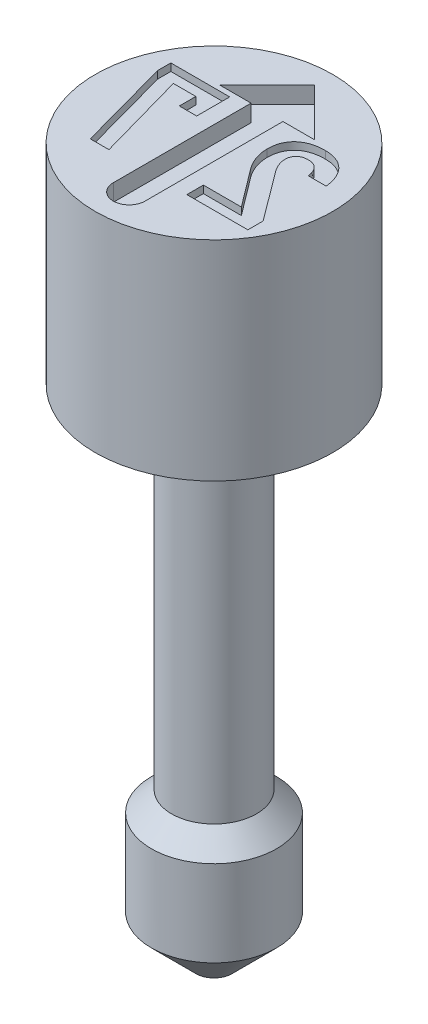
from build123d import *

# Parameters (mm, degrees)
CUT_EXTRUDE1_DEPTH = 0.4064
CUT_EXTRUDE2_DEPTH = 0.1778


with BuildPart() as part:
    # Sketch1 → Revolve1 (revolve)
    with BuildSketch(Plane.XY, mode=Mode.PRIVATE) as revolve1_sk:
        Polygon((0, 17.018), (2.8448, 17.018), (2.8448, 12.0142), (1.016, 12.0142), (1.016, 3.6068), (1.4986, 3.1242), (1.4986, 1.0668), (0.4318, 0), (0, 0), align=None)
    revolve(revolve1_sk.sketch.rotate(Axis((0, 0, 0), (0, 1, 0)), 90), axis=Axis((0, 0, 0), (0, 1, 0)))

    # Sketch2 → Cut-Extrude1 (cut)
    with BuildSketch(Plane(origin=(0, 17.018, 0), x_dir=(1, 0, 0), z_dir=(0, 1, 0))):
        with BuildLine():
            Line((0.381, -2.032), (0.381, 1.27))
            Line((0.381, 1.27), (1.143, 1.27))
            Line((1.143, 1.27), (0, 2.413))
            Line((0, 2.413), (-1.143, 1.27))
            Line((-1.143, 1.27), (-0.381, 1.27))
            Line((-0.381, 1.27), (-0.381, -2.032))
            ThreePointArc((-0.381, -2.032), (0, -2.413), (0.381, -2.032))
        make_face()
    extrude(amount=-CUT_EXTRUDE1_DEPTH, mode=Mode.SUBTRACT)

    # Sketch3 → Cut-Extrude2 (cut)
    with BuildSketch(Plane(origin=(0, 17.018, 0), x_dir=(1, 0, 0), z_dir=(0, 1, 0))):
        with BuildLine():
            Line((2.207862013, -1.397), (2.207862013, -1.030534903))
            Line((2.207862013, -1.030534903), (1.332675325, 0.142565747))
            add(Edge.make_bspline(
                [(1.332675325, 0.142565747), (1.321845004, 0.157561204), (1.300488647, 0.187130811), (1.271910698, 0.23310509), (1.247836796, 0.280151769), (1.227077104, 0.327401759), (1.210817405, 0.374306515), (1.198532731, 0.419873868), (1.191756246, 0.463986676), (1.190511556, 0.49286125), (1.189903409, 0.506969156)],
                knots=[0, 0, 0, 0, 1.116221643, 2.201082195, 3.263105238, 4.303340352, 5.313368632, 6.256511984, 7.148144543, 8, 8, 8, 8], degree=3))
            Line((1.189903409, 0.506969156), (1.189903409, 0.51057711))
            add(Edge.make_bspline(
                [(1.189903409, 0.51057711), (1.190598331, 0.530960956), (1.191927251, 0.569941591), (1.207341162, 0.624505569), (1.231841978, 0.671982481), (1.266778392, 0.71126672), (1.310245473, 0.742528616), (1.362177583, 0.765083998), (1.422295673, 0.777513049), (1.464910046, 0.779237), (1.487301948, 0.780142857)],
                knots=[0, 0, 0, 0, 1.070617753, 2.047374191, 2.957911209, 3.861726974, 4.788257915, 5.756429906, 6.821106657, 8, 8, 8, 8], degree=3))
            add(Edge.make_bspline(
                [(1.487301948, 0.780142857), (1.50873685, 0.779343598), (1.550241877, 0.77779597), (1.609155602, 0.760309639), (1.662566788, 0.733442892), (1.708589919, 0.694620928), (1.747271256, 0.646229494), (1.777934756, 0.588646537), (1.799402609, 0.521707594), (1.807010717, 0.473776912), (1.810987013, 0.448726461)],
                knots=[0, 0, 0, 0, 0.999891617, 1.936119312, 2.849186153, 3.779495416, 4.728470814, 5.731748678, 6.81452301, 8, 8, 8, 8], degree=3))
            Line((1.810987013, 0.448726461), (1.810987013, 0.447180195))
            Line((1.810987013, 0.447180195), (2.238787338, 0.447180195))
            Line((2.238787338, 0.447180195), (2.238787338, 0.448726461))
            add(Edge.make_bspline(
                [(2.238787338, 0.448726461), (2.235490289, 0.476980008), (2.229055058, 0.532125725), (2.21155193, 0.611592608), (2.190135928, 0.686323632), (2.163305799, 0.756220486), (2.131287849, 0.821182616), (2.094797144, 0.881690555), (2.05201228, 0.936290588), (2.005326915, 0.986613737), (1.953543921, 1.0308431), (1.898167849, 1.069727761), (1.839210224, 1.102925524), (1.776479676, 1.129850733), (1.710073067, 1.15034669), (1.640254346, 1.165384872), (1.566728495, 1.174155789), (1.516532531, 1.175368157), (1.490909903, 1.175987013)],
                knots=[0, 0, 0, 0, 1.176458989, 2.296231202, 3.362707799, 4.39127888, 5.389699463, 6.356664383, 7.309489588, 8.255125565, 9.192870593, 10.121896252, 11.051411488, 11.987780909, 12.941242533, 13.922967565, 14.939774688, 16, 16, 16, 16], degree=3))
            add(Edge.make_bspline(
                [(1.490909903, 1.175987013), (1.462538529, 1.17557382), (1.407385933, 1.174770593), (1.327297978, 1.166223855), (1.252073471, 1.153098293), (1.181776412, 1.134142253), (1.116546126, 1.109350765), (1.056321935, 1.079247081), (1.000710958, 1.044270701), (0.95053783, 1.003235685), (0.905731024, 0.957456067), (0.866530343, 0.907100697), (0.834173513, 0.8517342), (0.806346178, 0.792472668), (0.786203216, 0.728029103), (0.771041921, 0.659610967), (0.762365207, 0.586565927), (0.761170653, 0.53637056), (0.760556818, 0.51057711)],
                knots=[0, 0, 0, 0, 1.211483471, 2.355066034, 3.436186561, 4.470562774, 5.460097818, 6.411901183, 7.342329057, 8.260432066, 9.17382984, 10.073682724, 10.9786387, 11.907937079, 12.864144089, 13.855989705, 14.898276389, 16, 16, 16, 16], degree=3))
            Line((0.760556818, 0.51057711), (0.760556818, 0.509030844))
            add(Edge.make_bspline(
                [(0.760556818, 0.509030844), (0.761232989, 0.483045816), (0.762591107, 0.430853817), (0.77433628, 0.352325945), (0.791296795, 0.272982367), (0.817077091, 0.193967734), (0.848125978, 0.115731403), (0.885982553, 0.040056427), (0.929184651, -0.033281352), (0.962723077, -0.079158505), (0.979611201, -0.10225974)],
                knots=[0, 0, 0, 0, 0.943703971, 1.895468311, 2.880041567, 3.888955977, 4.911454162, 5.936103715, 6.960734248, 8, 8, 8, 8], degree=3))
            Line((0.979611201, -0.10225974), (1.65636039, -1.001155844))
            Line((1.65636039, -1.001155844), (0.746640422, -1.001155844))
            Line((0.746640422, -1.001155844), (0.746640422, -1.397))
            Line((0.746640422, -1.397), (2.207862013, -1.397))
        make_face()
        Polygon((-2.177039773, 1.143), (-2.177039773, 0.828592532), (-1.56626461, -1.397), (-1.119393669, -1.397), (-1.720891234, 0.747155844), (-1.18175974, 0.747155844), (-1.18175974, 0.351311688), (-0.766329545, 0.351311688), (-0.766329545, 1.143), align=None)
    extrude(amount=-CUT_EXTRUDE2_DEPTH, mode=Mode.SUBTRACT)


solid = part.part
